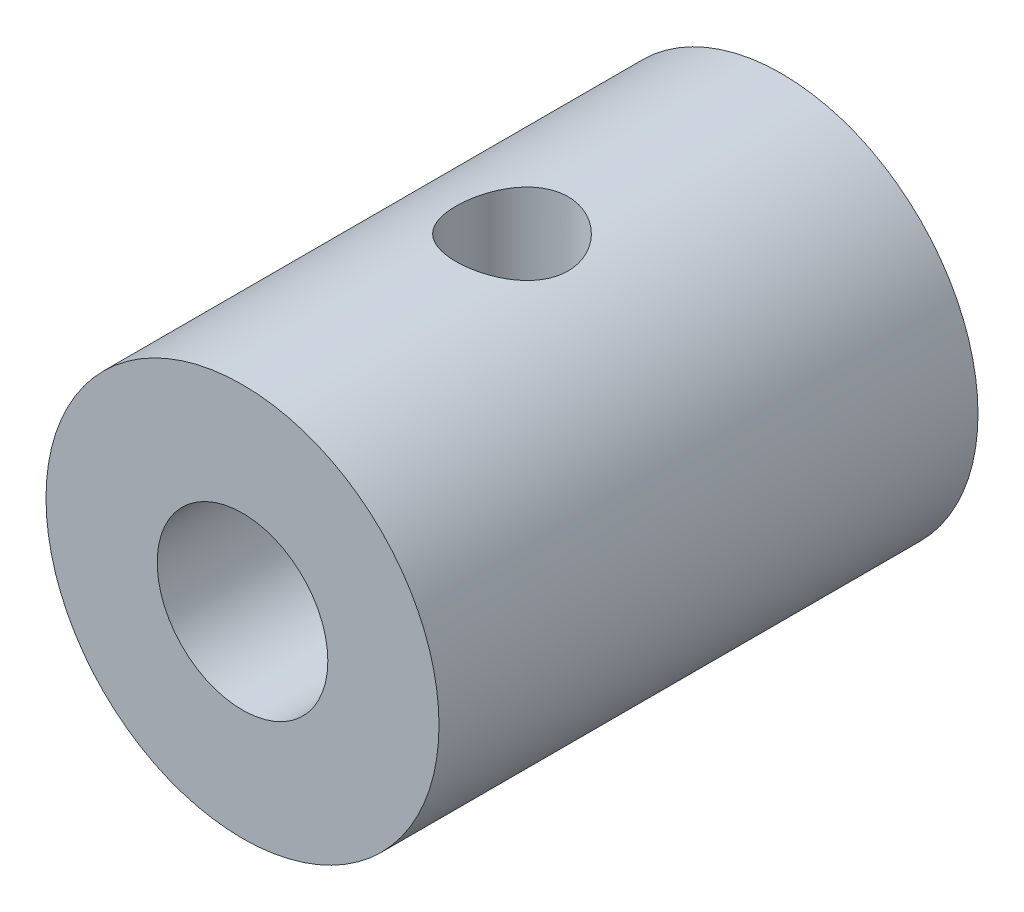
from build123d import *

# Parameters (mm, degrees)
SKETCH2_R               = 5.55625
SKETCH2_R_2             = 2.413
BOSS_EXTRUDE1_DEPTH     = 15.24
CUT_EXTRUDE1_DEPTH      = 18.146469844
CUT_EXTRUDE1_DEPTH_BACK = 18.146469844
SKETCH3_R               = 1.5875


with BuildPart() as part:
    # Sketch2 → Boss-Extrude1 (new body)
    with BuildSketch(Plane.XY):
        Circle(SKETCH2_R)
        Circle(SKETCH2_R_2, mode=Mode.SUBTRACT)
    extrude(amount=-BOSS_EXTRUDE1_DEPTH)

    # Sketch3 → Cut-Extrude1 (cut, two sides: drawn at the far end of the back side and taken through both)
    with BuildSketch(Plane(origin=(0, 0, 0), x_dir=(1, 0, 0), z_dir=(0, 1, 0)).offset(-CUT_EXTRUDE1_DEPTH_BACK)):
        with Locations(Location((0, 7.62, 0), (0, 0, 270))):
            Circle(SKETCH3_R)
    extrude(amount=CUT_EXTRUDE1_DEPTH + CUT_EXTRUDE1_DEPTH_BACK, mode=Mode.SUBTRACT)


solid = part.part
